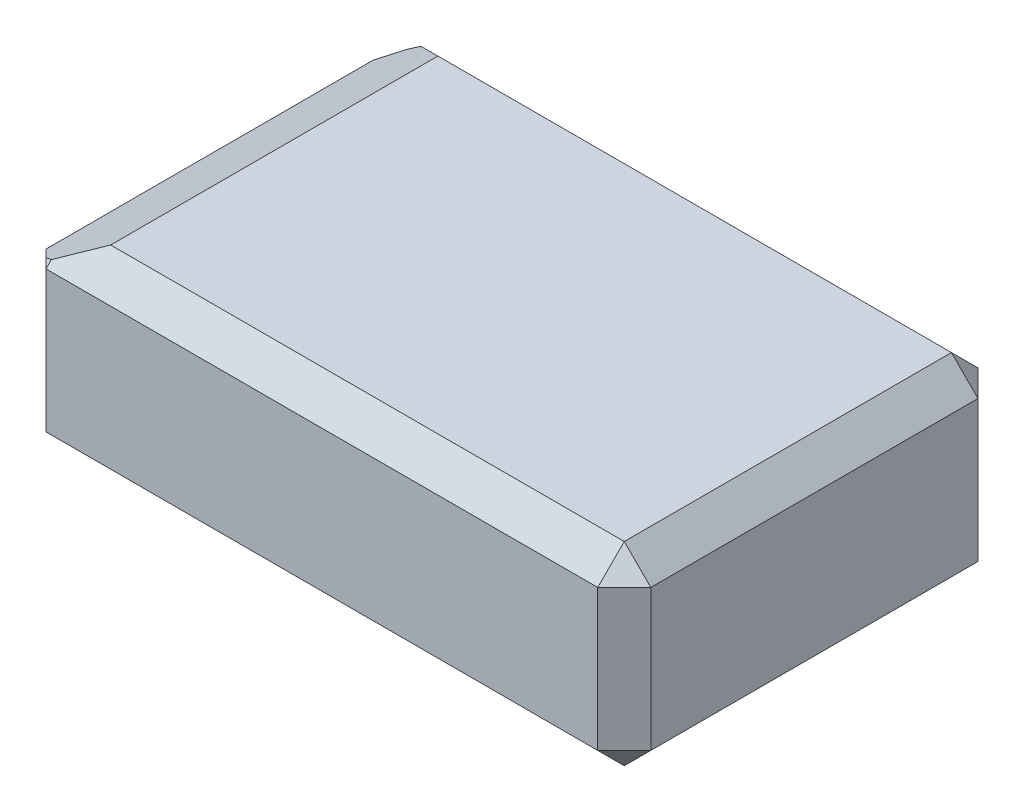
from build123d import *

# Parameters (mm, degrees)
SKETCH1_W           = 228
SKETCH1_H           = 143.36
BOSS_EXTRUDE1_DEPTH = 73.22
CHAMFER1_SIZE       = 10


with BuildPart() as part:
    # Sketch1 → Boss-Extrude1 (new body)
    with BuildSketch(Plane(origin=(0, 0, 0), x_dir=(1, 0, 0), z_dir=(0, 1, 0))):
        Rectangle(SKETCH1_W, SKETCH1_H)
    extrude(amount=BOSS_EXTRUDE1_DEPTH)

    # Chamfer1
    chamfer1_edges = [part.edges().sort_by_distance(p)[0] for p in [
        (0, 73.22, 71.68),
        (-114, 73.22, 0),
        (0, 73.22, -71.68),
        (-114, 0, 0),
        (0, 0, 71.68),
        (114, 0, 0),
        (0, 0, -71.68),
        (-114, 36.61, -71.68),
        (-114, 36.61, 71.68),
        (114, 36.61, 71.68),
        (114, 36.61, -71.68),
        (114, 73.22, 0),
    ]]
    chamfer(chamfer1_edges, length=CHAMFER1_SIZE)


with BuildPart() as body_2:
    # Split2: the piece on the far side of the plane
    add(part.part)
    split(bisect_by=Plane(origin=(-155.658056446, 36.609999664, 70.643590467), x_dir=(-0.8746197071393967, -0.4848096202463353, 0), z_dir=(0.4848096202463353, -0.8746197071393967, -4.206075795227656e-09)), keep=Keep.BOTTOM)


with BuildPart() as part_1:
    add(part.part)

    # Split2
    split(bisect_by=Plane(origin=(-155.658056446, 36.609999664, 70.643590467), x_dir=(-0.8746197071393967, -0.4848096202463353, 0), z_dir=(0.4848096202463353, -0.8746197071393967, -4.206075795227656e-09)), keep=Keep.TOP)


solid = part_1.part
